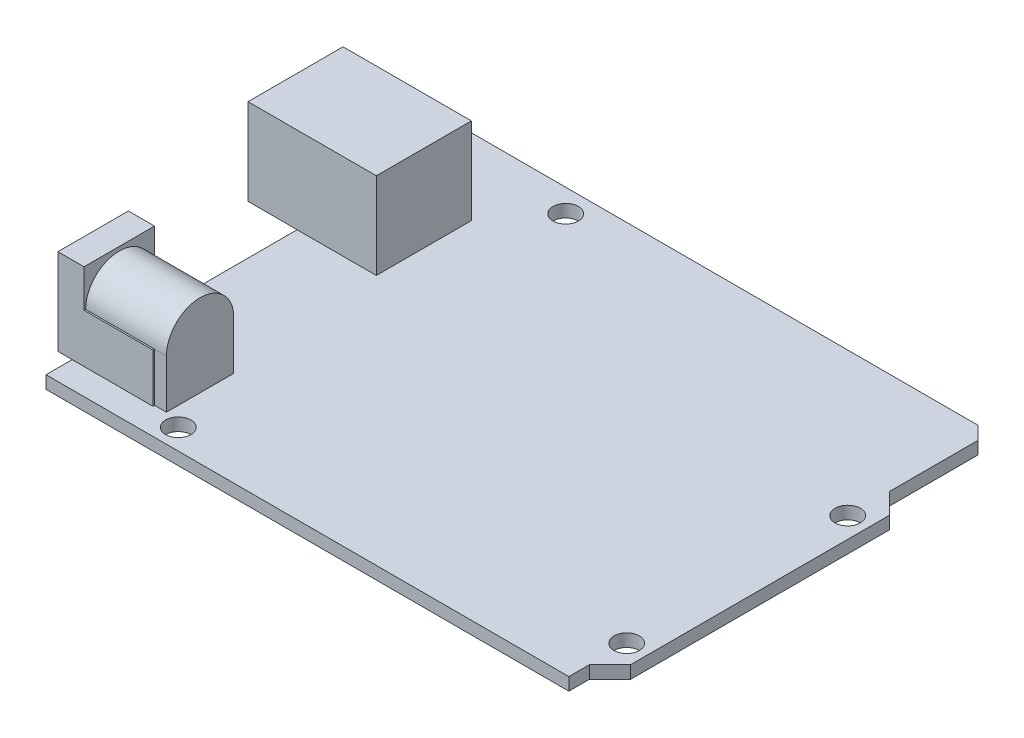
from build123d import *

# Parameters (mm, degrees)
SKETCH_1_R          = 1.6
EXTRUDE_1_DEPTH     = 1.6
SKETCH_3_W          = 16.2
SKETCH_3_H          = 12
EXTRUDE_2_DEPTH     = 10.9
SKETCH_4_W          = 13.5
SKETCH_4_H          = 8.9
EXTRUDE_3_DEPTH     = 10.9
SKETCH_5_W          = 0.2
SKETCH_5_H          = 6.15
CUT_EXTRUDE_1_DEPTH = 1.5
CUT_EXTRUDE_2_DEPTH = 10.2
SKETCH_7_R          = 3.1
CUT_EXTRUDE_3_DEPTH = 10.2


with BuildPart() as part:
    # Sketch 1 → Extrude 1 (new body)
    with BuildSketch(Plane(origin=(0, 0, 0), x_dir=(1, 0, 0), z_dir=(0, 1, 0))):
        Polygon((30.05, 26.65), (31.7, 25), (31.7, 13.85), (34.3, 11.25), (34.3, -21.45), (31.7, -24.05), (31.7, -26.65), (-34.3, -26.65), (-34.3, 26.65), align=None)
        with Locations(Location((-19.1, 23.75, 0), (0, 0, 270))):
            Circle(SKETCH_1_R, mode=Mode.SUBTRACT)
        with Locations(Location((-20.2, -24.05, 0), (0, 0, 270))):
            Circle(SKETCH_1_R, mode=Mode.SUBTRACT)
        with Locations(Location((31.7, 8.55, 0), (0, 0, 270))):
            Circle(SKETCH_1_R, mode=Mode.SUBTRACT)
        with Locations(Location((31.7, -19.35, 0), (0, 0, 270))):
            Circle(SKETCH_1_R, mode=Mode.SUBTRACT)
    extrude(amount=EXTRUDE_1_DEPTH)

    # Sketch 3 → Extrude 2 (add)
    with BuildSketch(Plane(origin=(0, 1.6, 0), x_dir=(1, 0, 0), z_dir=(0, 1, 0))):
        with Locations((-32.4, 11.05)):
            Rectangle(SKETCH_3_W, SKETCH_3_H)
    extrude(amount=EXTRUDE_2_DEPTH)

    # Sketch 4 → Extrude 3 (add)
    with BuildSketch(Plane(origin=(0, 1.6, 0), x_dir=(1, 0, 0), z_dir=(0, 1, 0))):
        with Locations((-29.35, -18.9)):
            Rectangle(SKETCH_4_W, SKETCH_4_H)
    extrude(amount=EXTRUDE_3_DEPTH)

    # Sketch 5 → Cut-Extrude 1 (cut)
    with BuildSketch(Plane(origin=(-22.6, 0, 0), x_dir=(0, 0, -1), z_dir=(1, 0, 0))):
        with Locations((-23.25, 4.675)):
            Rectangle(SKETCH_5_W, SKETCH_5_H)
        with Locations((-14.55, 4.675)):
            Rectangle(SKETCH_5_W, SKETCH_5_H)
    extrude(amount=-CUT_EXTRUDE_1_DEPTH, mode=Mode.SUBTRACT)

    # Sketch 6 → Cut-Extrude 2 (cut)
    with BuildSketch(Plane(origin=(-22.6, 0, 0), x_dir=(0, 0, -1), z_dir=(1, 0, 0))):
        with BuildLine():
            Line((-24.118008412, 7.75), (-23.15, 7.75))
            ThreePointArc((-23.15, 7.75), (-18.9, 12), (-14.65, 7.75))
            Line((-14.65, 7.75), (-13.892126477, 7.75))
            Line((-13.892126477, 7.75), (-13.892126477, 13.039584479))
            Line((-13.892126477, 13.039584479), (-24.118008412, 13.039584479))
            Line((-24.118008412, 13.039584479), (-24.118008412, 7.75))
        make_face()
    extrude(amount=-CUT_EXTRUDE_2_DEPTH, mode=Mode.SUBTRACT)

    # Sketch 7 → Cut-Extrude 3 (cut)
    with BuildSketch(Plane.ZY.offset(36.1)):
        with Locations((18.9, 7.75)):
            Circle(SKETCH_7_R)
    extrude(amount=-CUT_EXTRUDE_3_DEPTH, mode=Mode.SUBTRACT)


solid = part.part
